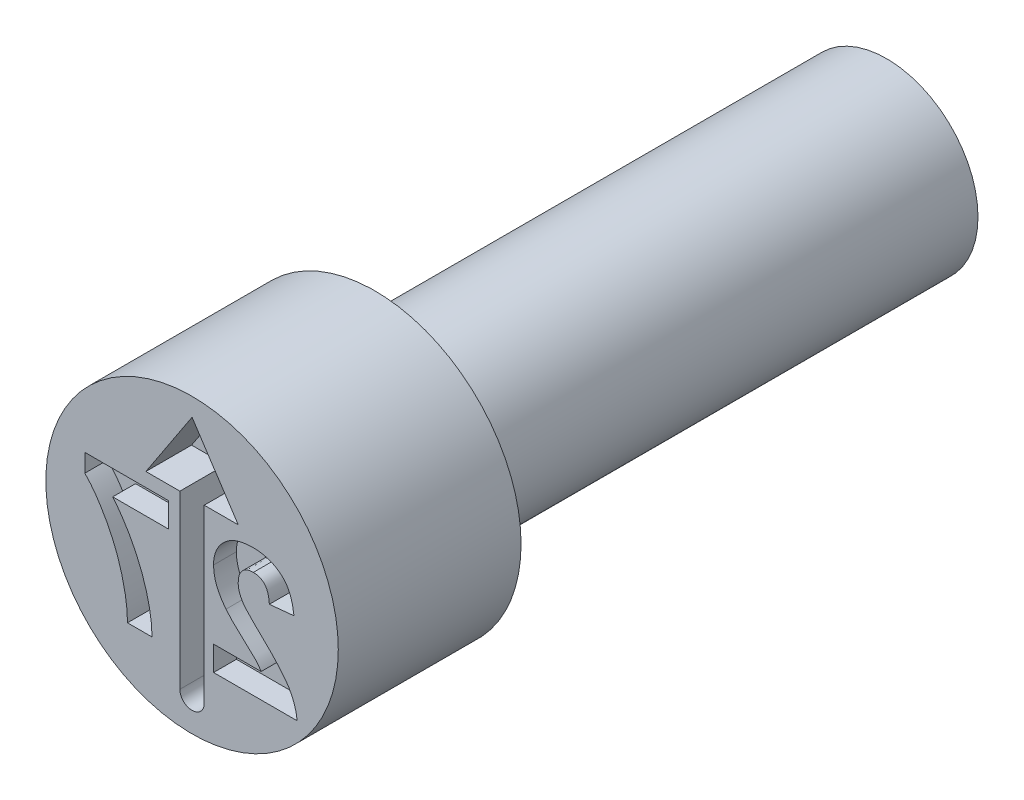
from build123d import *

# Parameters (mm, degrees)
CUT_EXTRUDE4_DEPTH = 0.25
CUT_EXTRUDE5_DEPTH = 0.125


with BuildPart() as part:
    # Sketch2 → Revolve1 (revolve)
    with BuildSketch(Plane(origin=(0, 0, 0), x_dir=(0, 0, -1), z_dir=(1, 0, 0)), mode=Mode.PRIVATE) as revolve1_sk:
        Polygon((0, 0.8), (0, 0), (3.8, 0), (3.8, 0.5), (1, 0.5), (1, 0.8), align=None)
    revolve(revolve1_sk.sketch.rotate(Axis((0, 0, -0.403888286), (0, 0, -1)), 90), axis=Axis((0, 0, -0.403888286), (0, 0, -1)))

    # Sketch3 → Cut-Extrude4 (cut)
    with BuildSketch(Plane.XY):
        with BuildLine():
            Line((0.066665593, 0.317223), (0.066665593, -0.621656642))
            ThreePointArc((0.066665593, -0.621656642), (0, -0.688322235), (-0.066665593, -0.621656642))
            Line((-0.066665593, -0.621656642), (-0.066665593, 0.317223))
            Line((-0.066665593, 0.317223), (-0.252671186, 0.317223))
            Line((-0.252671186, 0.317223), (0, 0.700740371))
            Line((0, 0.700740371), (0.252671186, 0.317223))
            Line((0.252671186, 0.317223), (0.066665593, 0.317223))
        make_face()
    extrude(amount=-CUT_EXTRUDE4_DEPTH, mode=Mode.SUBTRACT)

    # Sketch4 → Cut-Extrude5 (cut)
    with BuildSketch(Plane.XY):
        with BuildLine():
            Line((0.117670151, -0.315384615), (0.117670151, -0.45))
            Line((0.117670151, -0.45), (0.575362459, -0.45))
            add(Edge.make_bspline(
                [(0.575362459, -0.45), (0.573812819, -0.438495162), (0.570714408, -0.415491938), (0.561135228, -0.381890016), (0.548350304, -0.349100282), (0.534474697, -0.322417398), (0.520673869, -0.300938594), (0.508152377, -0.283338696), (0.493214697, -0.26461316), (0.476077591, -0.244610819), (0.456835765, -0.223269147), (0.435345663, -0.200667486), (0.411504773, -0.176914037), (0.394732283, -0.160784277), (0.386059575, -0.15244391)],
                knots=[0, 0, 0, 0, 1.156289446, 2.311930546, 3.473459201, 4.661751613, 5.303057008, 6.018253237, 6.81459331, 7.690699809, 8.644447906, 9.679642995, 10.800191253, 12, 12, 12, 12], degree=3))
            add(Edge.make_bspline(
                [(0.386059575, -0.15244391), (0.379138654, -0.145763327), (0.365963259, -0.133045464), (0.347201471, -0.114834), (0.330707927, -0.098092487), (0.316137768, -0.083254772), (0.303827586, -0.069943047), (0.293615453, -0.058366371), (0.285372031, -0.048477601), (0.280907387, -0.042204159), (0.278928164, -0.039423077)],
                knots=[0, 0, 0, 0, 1.480720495, 2.818855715, 4.024636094, 5.098235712, 6.019786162, 6.815086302, 7.474715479, 8, 8, 8, 8], degree=3))
            add(Edge.make_bspline(
                [(0.278928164, -0.039423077), (0.274875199, -0.032690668), (0.267057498, -0.019704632), (0.25848474, 0.000716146), (0.253339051, 0.021132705), (0.252632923, 0.034774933), (0.252285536, 0.041486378)],
                knots=[0, 0, 0, 0, 1.0911822, 2.104764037, 3.067617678, 4, 4, 4, 4], degree=3))
            add(Edge.make_bspline(
                [(0.252285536, 0.041486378), (0.252537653, 0.048470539), (0.253014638, 0.061684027), (0.25701424, 0.080330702), (0.264106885, 0.096360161), (0.273872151, 0.109821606), (0.286220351, 0.120368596), (0.300655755, 0.128161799), (0.317389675, 0.132470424), (0.329151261, 0.133037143), (0.335298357, 0.133333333)],
                knots=[0, 0, 0, 0, 1.193122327, 2.257294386, 3.237245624, 4.168877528, 5.075331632, 5.990371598, 6.949684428, 8, 8, 8, 8], degree=3))
            add(Edge.make_bspline(
                [(0.335298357, 0.133333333), (0.341403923, 0.133056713), (0.353198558, 0.132522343), (0.369961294, 0.127854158), (0.384625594, 0.119773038), (0.395076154, 0.110563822), (0.402136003, 0.101608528), (0.406946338, 0.09380458), (0.411092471, 0.084936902), (0.414766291, 0.075105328), (0.417668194, 0.064197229), (0.420005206, 0.05229568), (0.421888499, 0.039336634), (0.42248742, 0.030321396), (0.422798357, 0.025641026)],
                knots=[0, 0, 0, 0, 1.402788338, 2.709884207, 3.961032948, 5.225417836, 5.883680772, 6.578928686, 7.329201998, 8.132101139, 8.990263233, 9.922304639, 10.921339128, 12, 12, 12, 12], degree=3))
            Line((0.422798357, 0.025641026), (0.557413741, 0.038822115))
            add(Edge.make_bspline(
                [(0.557413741, 0.038822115), (0.556331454, 0.047910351), (0.554233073, 0.065530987), (0.548996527, 0.090840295), (0.542364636, 0.114189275), (0.534021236, 0.135534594), (0.524311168, 0.155011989), (0.512739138, 0.172329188), (0.499709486, 0.187678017), (0.485210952, 0.201050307), (0.469335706, 0.2124886), (0.452677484, 0.222699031), (0.434910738, 0.23107483), (0.41623108, 0.237977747), (0.396646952, 0.243494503), (0.376067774, 0.247142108), (0.354620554, 0.249707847), (0.339980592, 0.249901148), (0.332493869, 0.25)],
                knots=[0, 0, 0, 0, 1.270971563, 2.464210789, 3.586263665, 4.638946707, 5.643716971, 6.603612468, 7.52484387, 8.434700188, 9.336036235, 10.239171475, 11.145359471, 12.059630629, 13.003312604, 13.96741569, 14.960557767, 16, 16, 16, 16], degree=3))
            add(Edge.make_bspline(
                [(0.332493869, 0.25), (0.324354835, 0.249843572), (0.308503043, 0.249538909), (0.285362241, 0.247022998), (0.26362312, 0.242636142), (0.243095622, 0.236825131), (0.223990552, 0.229067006), (0.20614871, 0.219687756), (0.189850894, 0.208331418), (0.174854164, 0.195617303), (0.161448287, 0.181635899), (0.149705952, 0.166722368), (0.139868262, 0.1508871), (0.131612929, 0.134323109), (0.125483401, 0.116763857), (0.121017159, 0.09845214), (0.118055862, 0.079302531), (0.117800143, 0.066223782), (0.117670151, 0.059575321)],
                knots=[0, 0, 0, 0, 1.210756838, 2.35810096, 3.457354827, 4.507168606, 5.527358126, 6.519769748, 7.499700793, 8.476517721, 9.440526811, 10.376769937, 11.295256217, 12.209626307, 13.124630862, 14.055668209, 15.011616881, 16, 16, 16, 16], degree=3))
            add(Edge.make_bspline(
                [(0.117670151, 0.059575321), (0.117841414, 0.051944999), (0.118181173, 0.036807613), (0.121434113, 0.014430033), (0.126403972, -0.007431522), (0.133749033, -0.028830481), (0.143059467, -0.050280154), (0.15506084, -0.071828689), (0.168995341, -0.094125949), (0.179905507, -0.108542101), (0.185538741, -0.115985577)],
                knots=[0, 0, 0, 0, 0.953409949, 1.89141903, 2.821310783, 3.752688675, 4.715703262, 5.740811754, 6.833515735, 8, 8, 8, 8], degree=3))
            add(Edge.make_bspline(
                [(0.185538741, -0.115985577), (0.187667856, -0.118667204), (0.192227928, -0.124410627), (0.199985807, -0.133217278), (0.208976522, -0.142836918), (0.219073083, -0.153449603), (0.230608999, -0.164679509), (0.243169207, -0.176996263), (0.257306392, -0.189769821), (0.27194909, -0.203318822), (0.286655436, -0.216505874), (0.300172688, -0.22903065), (0.31245085, -0.240112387), (0.322918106, -0.250362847), (0.332190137, -0.259082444), (0.339932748, -0.266718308), (0.346290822, -0.273085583), (0.355051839, -0.283010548), (0.366199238, -0.296434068), (0.37404189, -0.309260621), (0.377786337, -0.315384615)],
                knots=[0, 0, 0, 0, 0.665555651, 1.425465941, 2.280616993, 3.225313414, 4.272635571, 5.410053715, 6.644756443, 7.976022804, 9.288331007, 10.484517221, 11.558462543, 12.503158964, 13.33222979, 14.032602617, 14.617328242, 15.080653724, 16.606167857, 18, 18, 18, 18], degree=3))
            Line((0.377786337, -0.315384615), (0.117670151, -0.315384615))
        make_face()
        with BuildLine():
            Line((-0.128945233, 0.106410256), (-0.128945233, 0.241025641))
            Line((-0.128945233, 0.241025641), (-0.586637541, 0.241025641))
            Line((-0.586637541, 0.241025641), (-0.586637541, 0.142307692))
            add(Edge.make_bspline(
                [(-0.586637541, 0.142307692), (-0.581862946, 0.137449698), (-0.572047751, 0.127463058), (-0.557988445, 0.111118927), (-0.543720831, 0.093382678), (-0.529543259, 0.074015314), (-0.515015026, 0.053322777), (-0.500774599, 0.030908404), (-0.486331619, 0.007062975), (-0.466886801, -0.026666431), (-0.444158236, -0.070727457), (-0.420112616, -0.125497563), (-0.399626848, -0.181949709), (-0.385599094, -0.230051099), (-0.376121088, -0.26860429), (-0.369928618, -0.296795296), (-0.364715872, -0.324192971), (-0.360475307, -0.350845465), (-0.357310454, -0.376764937), (-0.35480968, -0.401861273), (-0.353575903, -0.426195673), (-0.353393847, -0.442146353), (-0.353304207, -0.45)],
                knots=[0, 0, 0, 0, 0.628545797, 1.29210959, 1.98878689, 2.729126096, 3.507039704, 4.322017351, 5.179550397, 6.080149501, 7.915136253, 9.752312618, 11.597470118, 13.454141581, 14.373891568, 15.261584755, 16.117868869, 16.947726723, 17.752002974, 18.527724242, 19.275094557, 20, 20, 20, 20], degree=3))
            Line((-0.353304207, -0.45), (-0.218688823, -0.45))
            add(Edge.make_bspline(
                [(-0.218688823, -0.45), (-0.219138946, -0.438074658), (-0.220044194, -0.414091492), (-0.223431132, -0.378093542), (-0.228750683, -0.341961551), (-0.235357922, -0.305612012), (-0.244081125, -0.269133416), (-0.254036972, -0.232390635), (-0.266096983, -0.195579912), (-0.279615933, -0.158771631), (-0.294540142, -0.122315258), (-0.31080543, -0.086662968), (-0.32836975, -0.052037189), (-0.347004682, -0.018316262), (-0.366927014, 0.014391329), (-0.388151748, 0.046050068), (-0.410377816, 0.076888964), (-0.426269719, 0.096571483), (-0.434213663, 0.106410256)],
                knots=[0, 0, 0, 0, 0.943249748, 1.896978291, 2.856365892, 3.829648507, 4.816416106, 5.820376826, 6.838120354, 7.877341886, 8.919613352, 9.951365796, 10.974227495, 11.988073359, 12.996274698, 14.000568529, 15.000536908, 16, 16, 16, 16], degree=3))
            Line((-0.434213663, 0.106410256), (-0.128945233, 0.106410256))
        make_face()
    extrude(amount=-CUT_EXTRUDE5_DEPTH, mode=Mode.SUBTRACT)


solid = part.part
